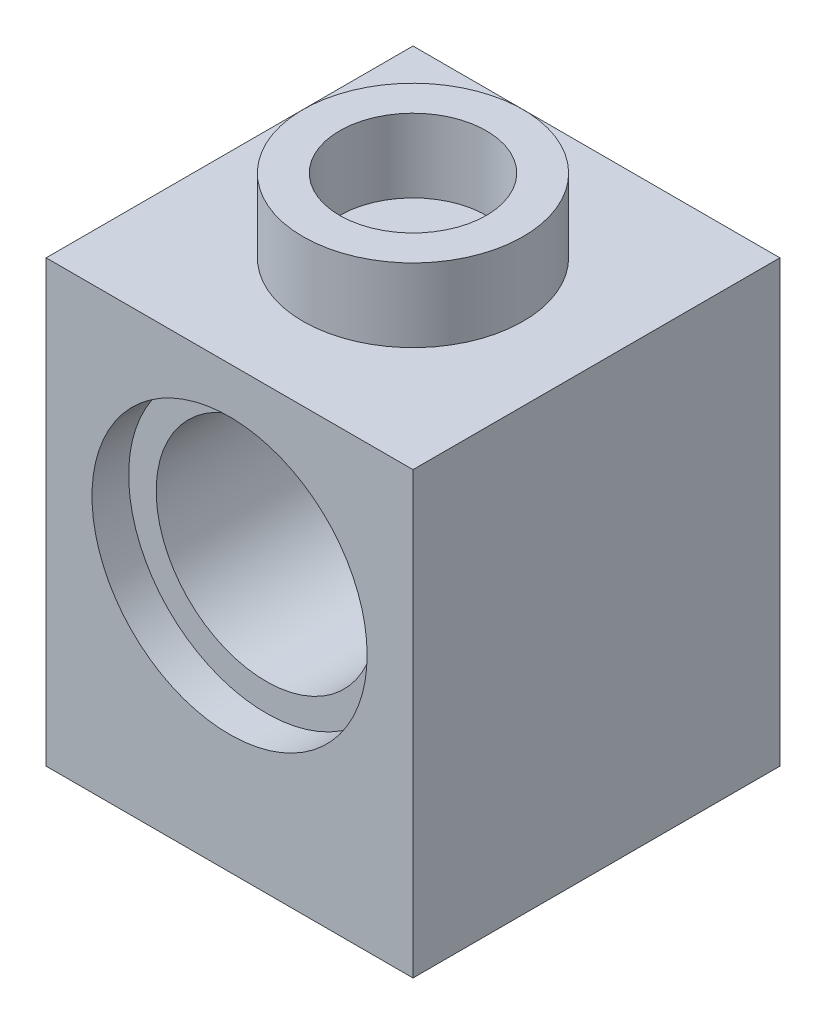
from build123d import *

# Parameters (mm, degrees)
SKETCH1_W           = 8
SKETCH1_H           = 8
BOSS_EXTRUDE1_DEPTH = 9.6
SKETCH2_R           = 3
CUT_EXTRUDE1_DEPTH  = 0.8
SKETCH3_R           = 2.4
CUT_EXTRUDE2_DEPTH  = 11.8
SKETCH5_R           = 2.4
SKETCH5_R_2         = 1.6
BOSS_EXTRUDE2_DEPTH = 1.6
SKETCH6_W           = 4.8
SKETCH6_H           = 4.8
CUT_EXTRUDE3_DEPTH  = 1.6


with BuildPart() as part:
    # Sketch1 → Boss-Extrude1 (new body)
    with BuildSketch(Plane(origin=(0, 0, 0), x_dir=(1, 0, 0), z_dir=(0, 1, 0))):
        with Locations((4, 4)):
            Rectangle(SKETCH1_W, SKETCH1_H)
    extrude(amount=BOSS_EXTRUDE1_DEPTH)

    # Sketch2 → Cut-Extrude1 (cut)
    with BuildSketch(Plane.XY):
        with Locations((4, 5.6)):
            Circle(SKETCH2_R)
    cut_extrude1 = extrude(amount=-CUT_EXTRUDE1_DEPTH, mode=Mode.SUBTRACT)

    # Sketch3 → Cut-Extrude2 (cut)
    with BuildSketch(Plane.XY):
        with Locations((4, 5.6)):
            Circle(SKETCH3_R)
    extrude(amount=-CUT_EXTRUDE2_DEPTH, mode=Mode.SUBTRACT)

    # Mirror1: Cut-Extrude1 across plane
    add(cut_extrude1.mirror(Plane.XY.offset(-4)), mode=Mode.SUBTRACT)

    # Sketch5 → Boss-Extrude2 (add)
    with BuildSketch(Plane(origin=(0, 9.6, 0), x_dir=(1, 0, 0), z_dir=(0, 1, 0))):
        with Locations(Location((4, 4, 0), (0, 0, 270))):
            Circle(SKETCH5_R)
        with Locations(Location((4, 4, 0), (0, 0, 270))):
            Circle(SKETCH5_R_2, mode=Mode.SUBTRACT)
    extrude(amount=BOSS_EXTRUDE2_DEPTH)

    # Sketch6 → Cut-Extrude3 (cut)
    with BuildSketch(Plane.XZ):
        with Locations((4, -4)):
            Rectangle(SKETCH6_W, SKETCH6_H)
    extrude(amount=-CUT_EXTRUDE3_DEPTH, mode=Mode.SUBTRACT)


solid = part.part
